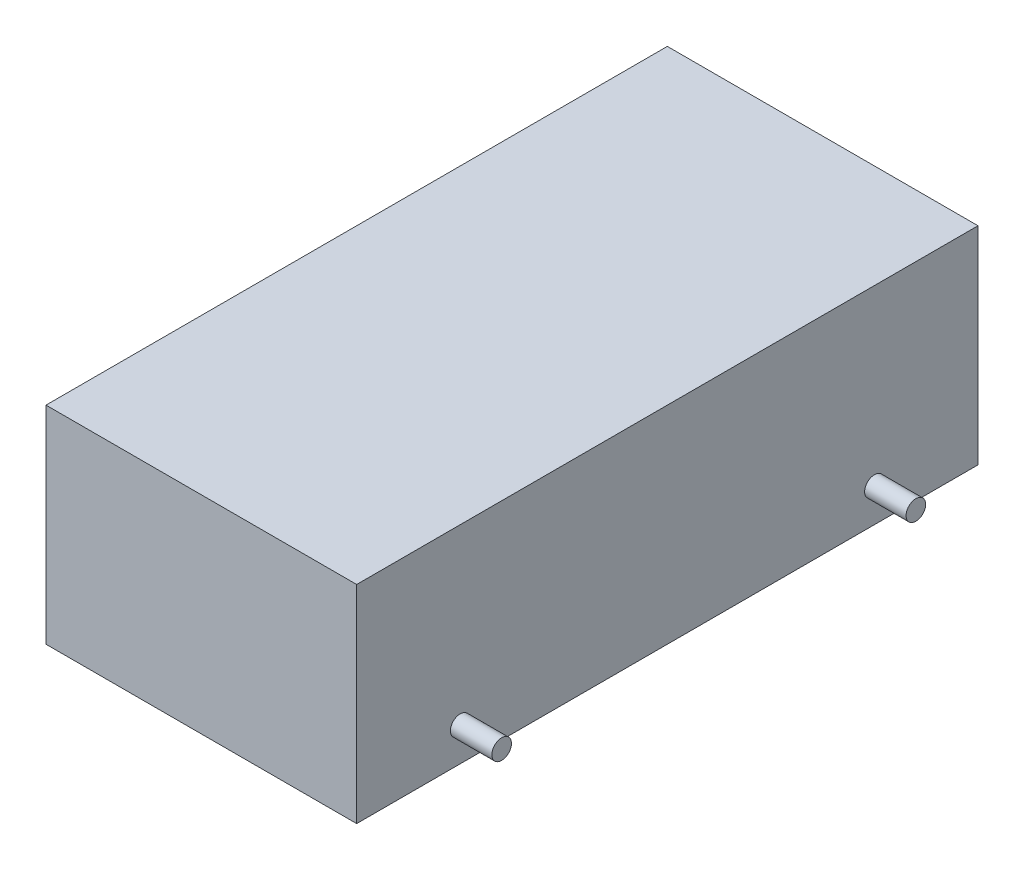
ISO-10303-21;
HEADER;
FILE_DESCRIPTION(('STEP AP214'),'2;1');
FILE_NAME('part.step','',(''),(''),'','','');
FILE_SCHEMA(('AUTOMOTIVE_DESIGN { 1 0 10303 214 1 1 1 1 }'));
ENDSEC;
DATA;
#1=APPLICATION_CONTEXT('core data for automotive mechanical design processes');
#2=APPLICATION_PROTOCOL_DEFINITION('international standard','automotive_design',2000,#1);
#3=PRODUCT_CONTEXT('',#1,'mechanical');
#4=PRODUCT('Part','Part','',(#3));
#5=PRODUCT_RELATED_PRODUCT_CATEGORY('part','',(#4));
#6=PRODUCT_DEFINITION_FORMATION('','',#4);
#7=PRODUCT_DEFINITION_CONTEXT('part definition',#1,'design');
#8=PRODUCT_DEFINITION('design','',#6,#7);
#9=PRODUCT_DEFINITION_SHAPE('','',#8);
#10=(LENGTH_UNIT() NAMED_UNIT(*) SI_UNIT(.MILLI.,.METRE.));
#11=(NAMED_UNIT(*) PLANE_ANGLE_UNIT() SI_UNIT($,.RADIAN.));
#12=(NAMED_UNIT(*) SI_UNIT($,.STERADIAN.) SOLID_ANGLE_UNIT());
#13=UNCERTAINTY_MEASURE_WITH_UNIT(LENGTH_MEASURE(1.E-05),#10,'distance_accuracy_value','');
#14=(GEOMETRIC_REPRESENTATION_CONTEXT(3) GLOBAL_UNCERTAINTY_ASSIGNED_CONTEXT((#13)) GLOBAL_UNIT_ASSIGNED_CONTEXT((#10,
#11,#12)) REPRESENTATION_CONTEXT('',''));
#15=CARTESIAN_POINT('',(0.,0.,0.));
#16=DIRECTION('',(0.,0.,1.));
#17=DIRECTION('',(1.,0.,0.));
#18=AXIS2_PLACEMENT_3D('',#15,#16,#17);
#19=CARTESIAN_POINT('',(-37.5,25.,150.));
#20=DIRECTION('',(1.,0.,0.));
#21=DIRECTION('',(0.,0.,-1.));
#22=AXIS2_PLACEMENT_3D('',#19,#20,#21);
#23=PLANE('',#22);
#24=CARTESIAN_POINT('',(-37.5,-16.9191545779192,125.));
#25=DIRECTION('',(1.,0.,0.));
#26=DIRECTION('',(0.,0.,-1.));
#27=AXIS2_PLACEMENT_3D('',#24,#25,#26);
#28=CIRCLE('',#27,2.36964720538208);
#29=CARTESIAN_POINT('',(-37.5,-16.9191545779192,122.630352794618));
#30=VERTEX_POINT('',#29);
#31=EDGE_CURVE('E11',#30,#30,#28,.F.);
#32=ORIENTED_EDGE('',*,*,#31,.F.);
#33=EDGE_LOOP('',(#32));
#34=FACE_BOUND('',#33,.T.);
#35=CARTESIAN_POINT('',(-37.5,-16.9191545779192,25.));
#36=DIRECTION('',(1.,0.,0.));
#37=DIRECTION('',(0.,0.,-1.));
#38=AXIS2_PLACEMENT_3D('',#35,#36,#37);
#39=CIRCLE('',#38,2.36964720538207);
#40=CARTESIAN_POINT('',(-37.5,-16.9191545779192,22.6303527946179));
#41=VERTEX_POINT('',#40);
#42=EDGE_CURVE('E50',#41,#41,#39,.F.);
#43=ORIENTED_EDGE('',*,*,#42,.F.);
#44=EDGE_LOOP('',(#43));
#45=FACE_BOUND('',#44,.T.);
#46=DIRECTION('',(0.,-1.,0.));
#47=VECTOR('',#46,1.);
#48=CARTESIAN_POINT('',(-37.5,25.,0.));
#49=LINE('',#48,#47);
#50=CARTESIAN_POINT('',(-37.5,25.,0.));
#51=VERTEX_POINT('',#50);
#52=CARTESIAN_POINT('',(-37.5,-25.,0.));
#53=VERTEX_POINT('',#52);
#54=EDGE_CURVE('E113',#51,#53,#49,.T.);
#55=ORIENTED_EDGE('',*,*,#54,.T.);
#56=DIRECTION('',(0.,0.,-1.));
#57=VECTOR('',#56,1.);
#58=CARTESIAN_POINT('',(-37.5,-25.,150.));
#59=LINE('',#58,#57);
#60=CARTESIAN_POINT('',(-37.5,-25.,150.));
#61=VERTEX_POINT('',#60);
#62=EDGE_CURVE('E102',#61,#53,#59,.T.);
#63=ORIENTED_EDGE('',*,*,#62,.F.);
#64=DIRECTION('',(0.,-1.,0.));
#65=VECTOR('',#64,1.);
#66=CARTESIAN_POINT('',(-37.5,25.,150.));
#67=LINE('',#66,#65);
#68=CARTESIAN_POINT('',(-37.5,25.,150.));
#69=VERTEX_POINT('',#68);
#70=EDGE_CURVE('E94',#69,#61,#67,.T.);
#71=ORIENTED_EDGE('',*,*,#70,.F.);
#72=DIRECTION('',(0.,0.,-1.));
#73=VECTOR('',#72,1.);
#74=CARTESIAN_POINT('',(-37.5,25.,150.));
#75=LINE('',#74,#73);
#76=EDGE_CURVE('E109',#69,#51,#75,.T.);
#77=ORIENTED_EDGE('',*,*,#76,.T.);
#78=EDGE_LOOP('',(#55,#63,#71,#77));
#79=FACE_BOUND('',#78,.T.);
#80=ADVANCED_FACE('F41',(#34,#45,#79),#23,.F.);
#81=CARTESIAN_POINT('',(-37.5,-25.,150.));
#82=DIRECTION('',(0.,1.,0.));
#83=DIRECTION('',(0.,0.,1.));
#84=AXIS2_PLACEMENT_3D('',#81,#82,#83);
#85=PLANE('',#84);
#86=DIRECTION('',(1.,0.,0.));
#87=VECTOR('',#86,1.);
#88=CARTESIAN_POINT('',(-37.5,-25.,0.));
#89=LINE('',#88,#87);
#90=CARTESIAN_POINT('',(37.5,-25.,0.));
#91=VERTEX_POINT('',#90);
#92=EDGE_CURVE('E100',#53,#91,#89,.T.);
#93=ORIENTED_EDGE('',*,*,#92,.T.);
#94=DIRECTION('',(0.,0.,-1.));
#95=VECTOR('',#94,1.);
#96=CARTESIAN_POINT('',(37.5,-25.,150.));
#97=LINE('',#96,#95);
#98=CARTESIAN_POINT('',(37.5,-25.,150.));
#99=VERTEX_POINT('',#98);
#100=EDGE_CURVE('E98',#99,#91,#97,.T.);
#101=ORIENTED_EDGE('',*,*,#100,.F.);
#102=DIRECTION('',(1.,0.,0.));
#103=VECTOR('',#102,1.);
#104=CARTESIAN_POINT('',(-37.5,-25.,150.));
#105=LINE('',#104,#103);
#106=EDGE_CURVE('E89',#61,#99,#105,.T.);
#107=ORIENTED_EDGE('',*,*,#106,.F.);
#108=ORIENTED_EDGE('',*,*,#62,.T.);
#109=EDGE_LOOP('',(#93,#101,#107,#108));
#110=FACE_BOUND('',#109,.T.);
#111=ADVANCED_FACE('F99',(#110),#85,.F.);
#112=CARTESIAN_POINT('',(37.5,25.,150.));
#113=DIRECTION('',(-1.,0.,0.));
#114=DIRECTION('',(0.,-1.,0.));
#115=AXIS2_PLACEMENT_3D('',#112,#113,#114);
#116=PLANE('',#115);
#117=CARTESIAN_POINT('',(37.5,-16.9191545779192,25.));
#118=DIRECTION('',(-1.,0.,0.));
#119=DIRECTION('',(0.,-1.,0.));
#120=AXIS2_PLACEMENT_3D('',#117,#118,#119);
#121=CIRCLE('',#120,2.36964720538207);
#122=CARTESIAN_POINT('',(37.5,-19.2888017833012,25.));
#123=VERTEX_POINT('',#122);
#124=EDGE_CURVE('E134',#123,#123,#121,.F.);
#125=ORIENTED_EDGE('',*,*,#124,.F.);
#126=EDGE_LOOP('',(#125));
#127=FACE_BOUND('',#126,.T.);
#128=CARTESIAN_POINT('',(37.5,-16.9191545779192,125.));
#129=DIRECTION('',(-1.,0.,0.));
#130=DIRECTION('',(0.,-1.,0.));
#131=AXIS2_PLACEMENT_3D('',#128,#129,#130);
#132=CIRCLE('',#131,2.36964720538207);
#133=CARTESIAN_POINT('',(37.5,-19.2888017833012,125.));
#134=VERTEX_POINT('',#133);
#135=EDGE_CURVE('E130',#134,#134,#132,.F.);
#136=ORIENTED_EDGE('',*,*,#135,.F.);
#137=EDGE_LOOP('',(#136));
#138=FACE_BOUND('',#137,.T.);
#139=DIRECTION('',(0.,1.,0.));
#140=VECTOR('',#139,1.);
#141=CARTESIAN_POINT('',(37.5,25.,0.));
#142=LINE('',#141,#140);
#143=CARTESIAN_POINT('',(37.5,25.,0.));
#144=VERTEX_POINT('',#143);
#145=EDGE_CURVE('E75',#91,#144,#142,.T.);
#146=ORIENTED_EDGE('',*,*,#145,.T.);
#147=DIRECTION('',(0.,0.,-1.));
#148=VECTOR('',#147,1.);
#149=CARTESIAN_POINT('',(37.5,25.,150.));
#150=LINE('',#149,#148);
#151=CARTESIAN_POINT('',(37.5,25.,150.));
#152=VERTEX_POINT('',#151);
#153=EDGE_CURVE('E103',#152,#144,#150,.T.);
#154=ORIENTED_EDGE('',*,*,#153,.F.);
#155=DIRECTION('',(0.,1.,0.));
#156=VECTOR('',#155,1.);
#157=CARTESIAN_POINT('',(37.5,25.,150.));
#158=LINE('',#157,#156);
#159=EDGE_CURVE('E92',#99,#152,#158,.T.);
#160=ORIENTED_EDGE('',*,*,#159,.F.);
#161=ORIENTED_EDGE('',*,*,#100,.T.);
#162=EDGE_LOOP('',(#146,#154,#160,#161));
#163=FACE_BOUND('',#162,.T.);
#164=ADVANCED_FACE('F105',(#127,#138,#163),#116,.F.);
#165=CARTESIAN_POINT('',(-37.5,25.,150.));
#166=DIRECTION('',(0.,-1.,0.));
#167=DIRECTION('',(0.,0.,-1.));
#168=AXIS2_PLACEMENT_3D('',#165,#166,#167);
#169=PLANE('',#168);
#170=DIRECTION('',(-1.,0.,0.));
#171=VECTOR('',#170,1.);
#172=CARTESIAN_POINT('',(-37.5,25.,0.));
#173=LINE('',#172,#171);
#174=EDGE_CURVE('E81',#144,#51,#173,.T.);
#175=ORIENTED_EDGE('',*,*,#174,.T.);
#176=ORIENTED_EDGE('',*,*,#76,.F.);
#177=DIRECTION('',(-1.,0.,0.));
#178=VECTOR('',#177,1.);
#179=CARTESIAN_POINT('',(-37.5,25.,150.));
#180=LINE('',#179,#178);
#181=EDGE_CURVE('E58',#152,#69,#180,.T.);
#182=ORIENTED_EDGE('',*,*,#181,.F.);
#183=ORIENTED_EDGE('',*,*,#153,.T.);
#184=EDGE_LOOP('',(#175,#176,#182,#183));
#185=FACE_BOUND('',#184,.T.);
#186=ADVANCED_FACE('F159',(#185),#169,.F.);
#187=CARTESIAN_POINT('',(0.,0.,150.));
#188=DIRECTION('',(0.,0.,1.));
#189=DIRECTION('',(1.,0.,0.));
#190=AXIS2_PLACEMENT_3D('',#187,#188,#189);
#191=PLANE('',#190);
#192=ORIENTED_EDGE('',*,*,#70,.T.);
#193=ORIENTED_EDGE('',*,*,#106,.T.);
#194=ORIENTED_EDGE('',*,*,#159,.T.);
#195=ORIENTED_EDGE('',*,*,#181,.T.);
#196=EDGE_LOOP('',(#192,#193,#194,#195));
#197=FACE_BOUND('',#196,.T.);
#198=ADVANCED_FACE('F90',(#197),#191,.T.);
#199=CARTESIAN_POINT('',(0.,0.,0.));
#200=DIRECTION('',(0.,0.,1.));
#201=DIRECTION('',(1.,0.,0.));
#202=AXIS2_PLACEMENT_3D('',#199,#200,#201);
#203=PLANE('',#202);
#204=ORIENTED_EDGE('',*,*,#54,.F.);
#205=ORIENTED_EDGE('',*,*,#174,.F.);
#206=ORIENTED_EDGE('',*,*,#145,.F.);
#207=ORIENTED_EDGE('',*,*,#92,.F.);
#208=EDGE_LOOP('',(#204,#205,#206,#207));
#209=FACE_BOUND('',#208,.T.);
#210=ADVANCED_FACE('F148',(#209),#203,.F.);
#211=CARTESIAN_POINT('',(47.5,-16.9191545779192,125.));
#212=DIRECTION('',(-1.,0.,0.));
#213=DIRECTION('',(0.,-1.,0.));
#214=AXIS2_PLACEMENT_3D('',#211,#212,#213);
#215=CYLINDRICAL_SURFACE('',#214,2.36964720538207);
#216=CARTESIAN_POINT('',(47.5,-16.9191545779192,125.));
#217=DIRECTION('',(1.,0.,0.));
#218=DIRECTION('',(0.,1.,0.));
#219=AXIS2_PLACEMENT_3D('',#216,#217,#218);
#220=CIRCLE('',#219,2.36964720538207);
#221=CARTESIAN_POINT('',(47.5,-14.5495073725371,125.));
#222=VERTEX_POINT('',#221);
#223=EDGE_CURVE('E117',#222,#222,#220,.T.);
#224=ORIENTED_EDGE('',*,*,#223,.F.);
#225=EDGE_LOOP('',(#224));
#226=FACE_BOUND('',#225,.T.);
#227=ORIENTED_EDGE('',*,*,#135,.T.);
#228=EDGE_LOOP('',(#227));
#229=FACE_BOUND('',#228,.T.);
#230=ADVANCED_FACE('F150',(#226,#229),#215,.T.);
#231=CARTESIAN_POINT('',(47.5,-16.9191545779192,125.));
#232=DIRECTION('',(1.,0.,0.));
#233=DIRECTION('',(0.,1.,0.));
#234=AXIS2_PLACEMENT_3D('',#231,#232,#233);
#235=PLANE('',#234);
#236=ORIENTED_EDGE('',*,*,#223,.T.);
#237=EDGE_LOOP('',(#236));
#238=FACE_BOUND('',#237,.T.);
#239=ADVANCED_FACE('F156',(#238),#235,.T.);
#240=CARTESIAN_POINT('',(47.5,-16.9191545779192,25.));
#241=DIRECTION('',(-1.,0.,0.));
#242=DIRECTION('',(0.,-1.,0.));
#243=AXIS2_PLACEMENT_3D('',#240,#241,#242);
#244=CYLINDRICAL_SURFACE('',#243,2.36964720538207);
#245=CARTESIAN_POINT('',(47.5,-16.9191545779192,25.));
#246=DIRECTION('',(1.,0.,0.));
#247=DIRECTION('',(0.,1.,0.));
#248=AXIS2_PLACEMENT_3D('',#245,#246,#247);
#249=CIRCLE('',#248,2.36964720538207);
#250=CARTESIAN_POINT('',(47.5,-14.5495073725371,25.));
#251=VERTEX_POINT('',#250);
#252=EDGE_CURVE('E263',#251,#251,#249,.T.);
#253=ORIENTED_EDGE('',*,*,#252,.F.);
#254=EDGE_LOOP('',(#253));
#255=FACE_BOUND('',#254,.T.);
#256=ORIENTED_EDGE('',*,*,#124,.T.);
#257=EDGE_LOOP('',(#256));
#258=FACE_BOUND('',#257,.T.);
#259=ADVANCED_FACE('F194',(#255,#258),#244,.T.);
#260=CARTESIAN_POINT('',(47.5,-16.9191545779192,25.));
#261=DIRECTION('',(1.,0.,0.));
#262=DIRECTION('',(0.,1.,0.));
#263=AXIS2_PLACEMENT_3D('',#260,#261,#262);
#264=PLANE('',#263);
#265=ORIENTED_EDGE('',*,*,#252,.T.);
#266=EDGE_LOOP('',(#265));
#267=FACE_BOUND('',#266,.T.);
#268=ADVANCED_FACE('F203',(#267),#264,.T.);
#269=CARTESIAN_POINT('',(-47.5,-16.9191545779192,25.));
#270=DIRECTION('',(1.,0.,0.));
#271=DIRECTION('',(0.,0.,-1.));
#272=AXIS2_PLACEMENT_3D('',#269,#270,#271);
#273=CYLINDRICAL_SURFACE('',#272,2.36964720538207);
#274=CARTESIAN_POINT('',(-47.5,-16.9191545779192,25.));
#275=DIRECTION('',(-1.,0.,0.));
#276=DIRECTION('',(0.,0.,1.));
#277=AXIS2_PLACEMENT_3D('',#274,#275,#276);
#278=CIRCLE('',#277,2.36964720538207);
#279=CARTESIAN_POINT('',(-47.5,-16.9191545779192,27.3696472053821));
#280=VERTEX_POINT('',#279);
#281=EDGE_CURVE('E259',#280,#280,#278,.T.);
#282=ORIENTED_EDGE('',*,*,#281,.F.);
#283=EDGE_LOOP('',(#282));
#284=FACE_BOUND('',#283,.T.);
#285=ORIENTED_EDGE('',*,*,#42,.T.);
#286=EDGE_LOOP('',(#285));
#287=FACE_BOUND('',#286,.T.);
#288=ADVANCED_FACE('F141',(#284,#287),#273,.T.);
#289=CARTESIAN_POINT('',(-47.5,-16.9191545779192,25.));
#290=DIRECTION('',(-1.,0.,0.));
#291=DIRECTION('',(0.,0.,1.));
#292=AXIS2_PLACEMENT_3D('',#289,#290,#291);
#293=PLANE('',#292);
#294=ORIENTED_EDGE('',*,*,#281,.T.);
#295=EDGE_LOOP('',(#294));
#296=FACE_BOUND('',#295,.T.);
#297=ADVANCED_FACE('F221',(#296),#293,.T.);
#298=CARTESIAN_POINT('',(-47.5,-16.9191545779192,125.));
#299=DIRECTION('',(1.,0.,0.));
#300=DIRECTION('',(0.,0.,-1.));
#301=AXIS2_PLACEMENT_3D('',#298,#299,#300);
#302=CYLINDRICAL_SURFACE('',#301,2.36964720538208);
#303=CARTESIAN_POINT('',(-47.5,-16.9191545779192,125.));
#304=DIRECTION('',(-1.,0.,0.));
#305=DIRECTION('',(0.,0.,1.));
#306=AXIS2_PLACEMENT_3D('',#303,#304,#305);
#307=CIRCLE('',#306,2.36964720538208);
#308=CARTESIAN_POINT('',(-47.5,-16.9191545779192,127.369647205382));
#309=VERTEX_POINT('',#308);
#310=EDGE_CURVE('E257',#309,#309,#307,.T.);
#311=ORIENTED_EDGE('',*,*,#310,.F.);
#312=EDGE_LOOP('',(#311));
#313=FACE_BOUND('',#312,.T.);
#314=ORIENTED_EDGE('',*,*,#31,.T.);
#315=EDGE_LOOP('',(#314));
#316=FACE_BOUND('',#315,.T.);
#317=ADVANCED_FACE('F228',(#313,#316),#302,.T.);
#318=CARTESIAN_POINT('',(-47.5,-16.9191545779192,125.));
#319=DIRECTION('',(-1.,0.,0.));
#320=DIRECTION('',(0.,0.,1.));
#321=AXIS2_PLACEMENT_3D('',#318,#319,#320);
#322=PLANE('',#321);
#323=ORIENTED_EDGE('',*,*,#310,.T.);
#324=EDGE_LOOP('',(#323));
#325=FACE_BOUND('',#324,.T.);
#326=ADVANCED_FACE('F236',(#325),#322,.T.);
#327=CLOSED_SHELL('',(#80,#111,#164,#186,#198,#210,#230,#239,#259,#268,#288,#297,#317,#326));
#328=MANIFOLD_SOLID_BREP('B2',#327);
#329=ADVANCED_BREP_SHAPE_REPRESENTATION('',(#18,#328),#14);
#330=SHAPE_DEFINITION_REPRESENTATION(#9,#329);
ENDSEC;
END-ISO-10303-21;
